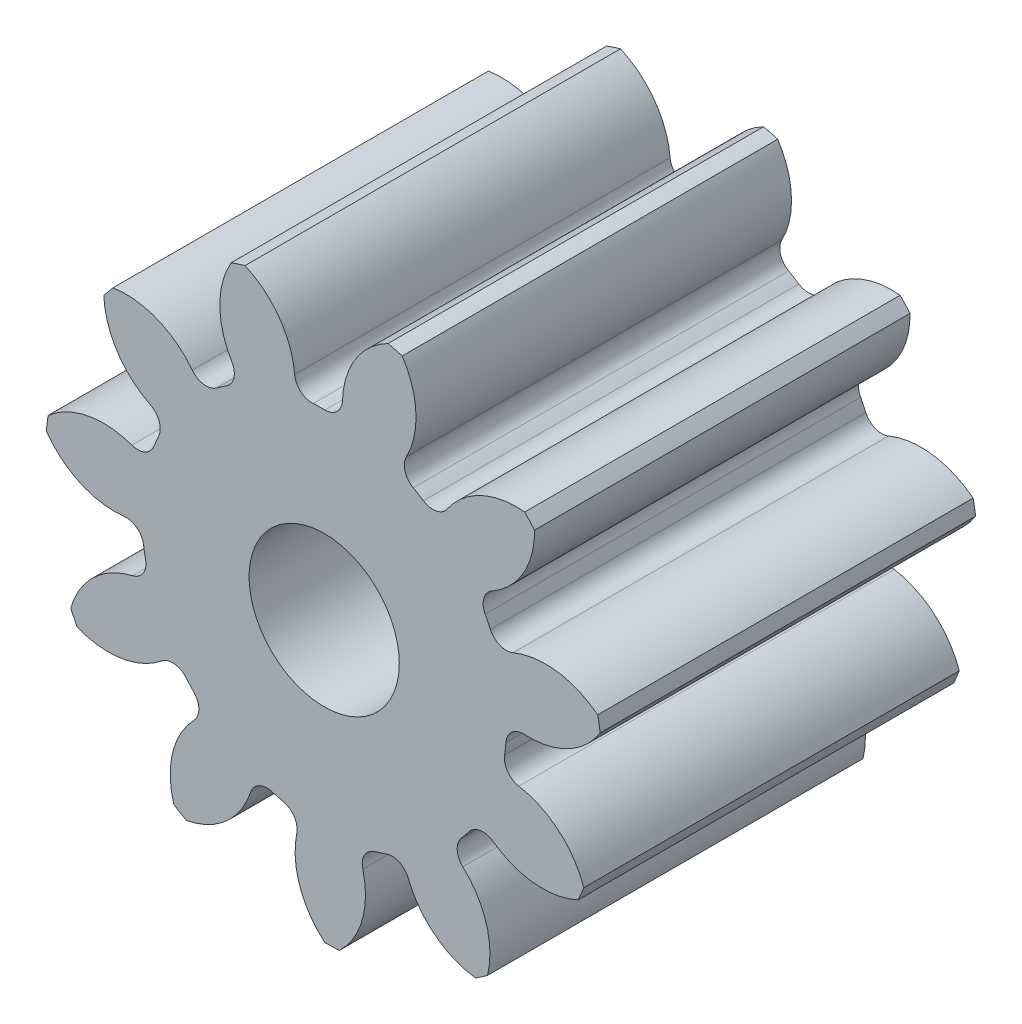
from build123d import *

# Parameters (mm, degrees)
SKETCH3_R         = 66.04
GEARBODY_DEPTH    = 88.9
TOOTHCUT_DEPTH    = 129.940967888
CIRPATTERN1_COUNT = 11
BOREDIA_R         = 17.78
BORE_DEPTH        = 12700


with BuildPart() as part:
    # Sketch3 → gearBody (new body)
    with BuildSketch(Plane.XY):
        Circle(SKETCH3_R)
    extrude(amount=GEARBODY_DEPTH)

    # Sketch2 → toothCut (cut, through all)
    with BuildSketch(Plane.XY):
        with BuildLine():
            ThreePointArc((42.714067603, -6.326201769), (42.897123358, -4.934491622), (43.034846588, -3.537566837))
            ThreePointArc((43.034846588, -3.537566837), (44.441523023, -0.756970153), (47.389758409, 0.252170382))
            ThreePointArc((47.389758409, 0.252170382), (58.24393309, 2.765669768), (66.04, 10.725074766))
            ThreePointArc((66.04, 10.725074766), (66.466919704, -7.645744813), (61.879923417, -25.439809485))
            ThreePointArc((61.879923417, -25.439809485), (56.094719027, -15.918139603), (46.094748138, -11.005770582))
            ThreePointArc((46.094748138, -11.005770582), (43.45264911, -9.35356925), (42.714067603, -6.326201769))
        make_face()
    toothcut = extrude(amount=TOOTHCUT_DEPTH, mode=Mode.SUBTRACT)

    # CirPattern1: toothCut ×11 about axis
    cirpattern1_axis = Axis((0, 0, 0), (0, 0, 1))
    for i in range(1, CIRPATTERN1_COUNT):
        add(toothcut.rotate(cirpattern1_axis, i * 360 / CIRPATTERN1_COUNT), mode=Mode.SUBTRACT)

    # boreDia → bore (cut, symmetric)
    with BuildSketch(Plane.XY):
        Circle(BOREDIA_R)
    extrude(amount=BORE_DEPTH, both=True, mode=Mode.SUBTRACT)


solid = part.part
